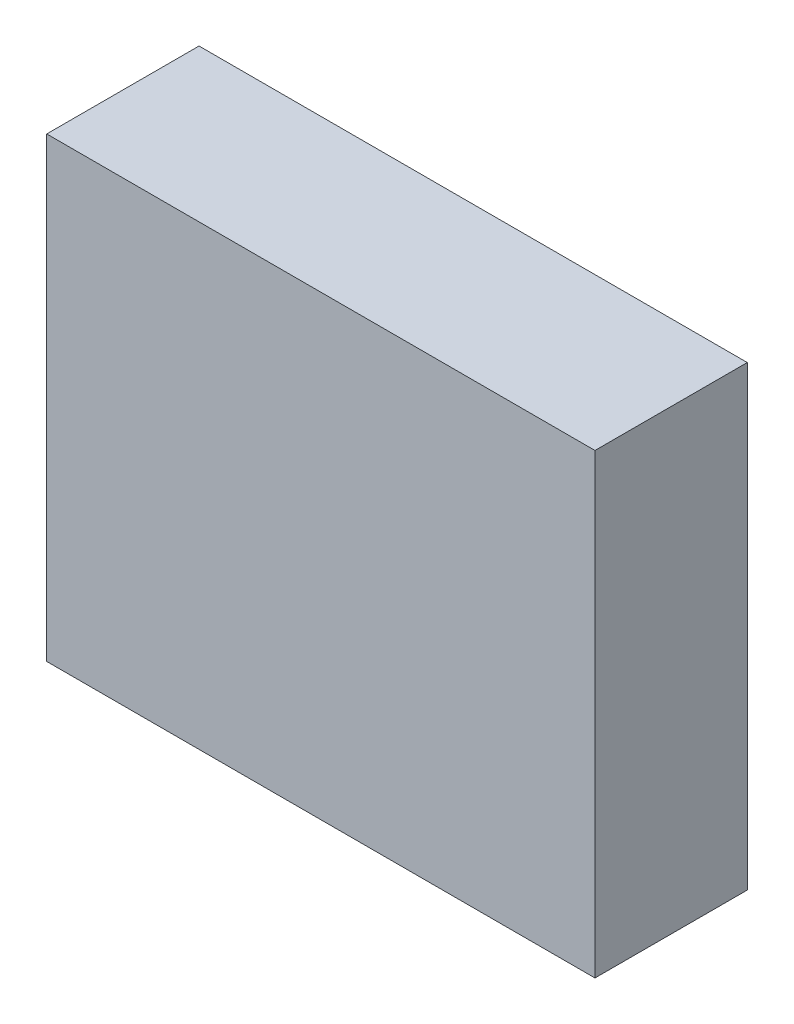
from build123d import *

# Parameters (mm, degrees)
GENERAL_W           = 3.599999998
GENERAL_H           = 3
BOSS_EXTRUDE1_DEPTH = 0.999999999


with BuildPart() as part:
    # GENERAL → Boss-Extrude1 (new body)
    with BuildSketch(Plane.XY):
        Rectangle(GENERAL_W, GENERAL_H)
    extrude(amount=BOSS_EXTRUDE1_DEPTH)


solid = part.part
